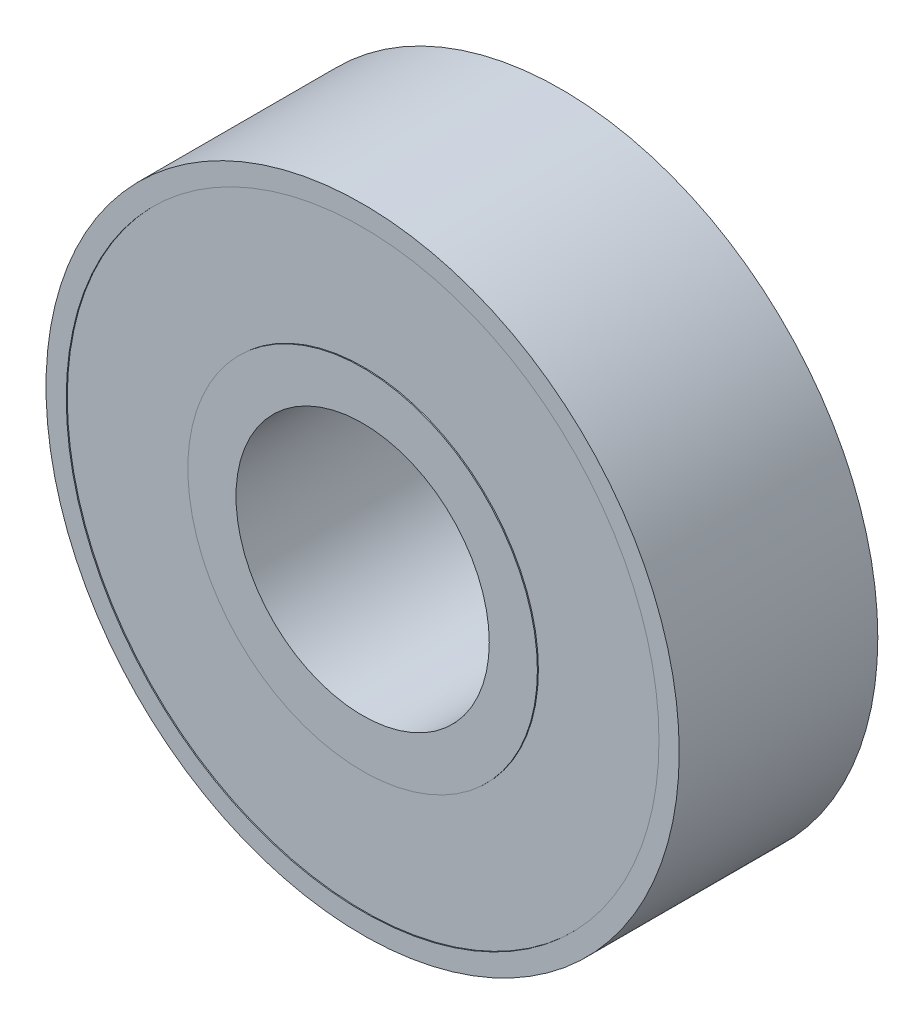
from build123d import *

# Parameters (mm, degrees)
SKETCH1_R           = 7.9375
SKETCH1_R_2         = 3.175
BOSS_EXTRUDE1_DEPTH = 2.4892
SKETCH3_R           = 7.4295
SKETCH3_R_2         = 4.3815
CUT_EXTRUDE1_DEPTH  = 0.0254


with BuildPart() as part:
    # Sketch1 → Boss-Extrude1 (new, symmetric)
    with BuildSketch(Plane.XY):
        Circle(SKETCH1_R)
        Circle(SKETCH1_R_2, mode=Mode.SUBTRACT)
    extrude(amount=BOSS_EXTRUDE1_DEPTH, both=True)

    # Sketch3 → Cut-Extrude1 (cut)
    with BuildSketch(Plane.XY.offset(2.4892)):
        Circle(SKETCH3_R)
        Circle(SKETCH3_R_2, mode=Mode.SUBTRACT)
    cut_extrude1 = extrude(amount=-CUT_EXTRUDE1_DEPTH, mode=Mode.SUBTRACT)

    # Mirror1: Cut-Extrude1 across plane
    add(cut_extrude1.mirror(Plane.XY), mode=Mode.SUBTRACT)


solid = part.part
